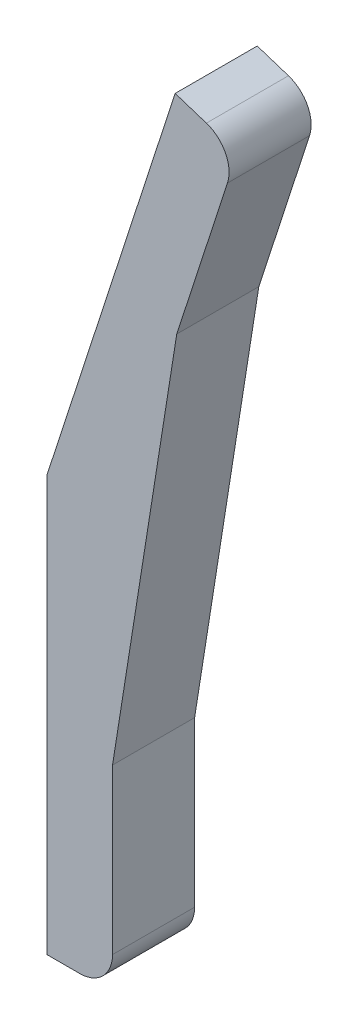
from build123d import *

# Parameters (mm, degrees)
BOSS_EXTRUDE1_DEPTH = 6.35
FILLET1_R           = 2.54


with BuildPart() as part:
    # Sketch1 → Boss-Extrude1 (new body)
    with BuildSketch(Plane.XY):
        Polygon((0, 0), (0, -32.117476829), (5.08, -32.117476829), (5.08, -16.877476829), (10.046794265, 14.481627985), (14.756213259, 28.975729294), (9.924846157, 30.545535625), align=None)
    extrude(amount=-BOSS_EXTRUDE1_DEPTH)

    # Fillet1
    fillet1_edges = [part.edges().sort_by_distance(p)[0] for p in [
        (14.756213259, 28.975729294, -3.175),
        (5.08, -32.117476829, -3.175),
    ]]
    fillet(fillet1_edges, radius=FILLET1_R)


solid = part.part
